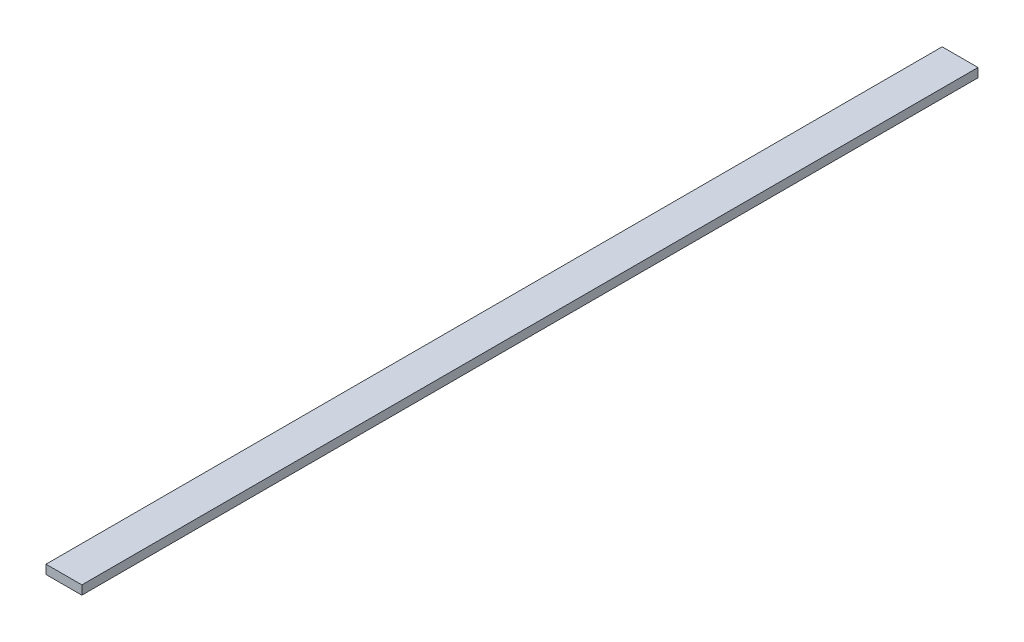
ISO-10303-21;
HEADER;
FILE_DESCRIPTION(('STEP AP214'),'2;1');
FILE_NAME('part.step','',(''),(''),'','','');
FILE_SCHEMA(('AUTOMOTIVE_DESIGN { 1 0 10303 214 1 1 1 1 }'));
ENDSEC;
DATA;
#1=APPLICATION_CONTEXT('core data for automotive mechanical design processes');
#2=APPLICATION_PROTOCOL_DEFINITION('international standard','automotive_design',2000,#1);
#3=PRODUCT_CONTEXT('',#1,'mechanical');
#4=PRODUCT('Part','Part','',(#3));
#5=PRODUCT_RELATED_PRODUCT_CATEGORY('part','',(#4));
#6=PRODUCT_DEFINITION_FORMATION('','',#4);
#7=PRODUCT_DEFINITION_CONTEXT('part definition',#1,'design');
#8=PRODUCT_DEFINITION('design','',#6,#7);
#9=PRODUCT_DEFINITION_SHAPE('','',#8);
#10=(LENGTH_UNIT() NAMED_UNIT(*) SI_UNIT(.MILLI.,.METRE.));
#11=(NAMED_UNIT(*) PLANE_ANGLE_UNIT() SI_UNIT($,.RADIAN.));
#12=(NAMED_UNIT(*) SI_UNIT($,.STERADIAN.) SOLID_ANGLE_UNIT());
#13=UNCERTAINTY_MEASURE_WITH_UNIT(LENGTH_MEASURE(1.E-05),#10,'distance_accuracy_value','');
#14=(GEOMETRIC_REPRESENTATION_CONTEXT(3) GLOBAL_UNCERTAINTY_ASSIGNED_CONTEXT((#13)) GLOBAL_UNIT_ASSIGNED_CONTEXT((#10,
#11,#12)) REPRESENTATION_CONTEXT('',''));
#15=CARTESIAN_POINT('',(0.,0.,0.));
#16=DIRECTION('',(0.,0.,1.));
#17=DIRECTION('',(1.,0.,0.));
#18=AXIS2_PLACEMENT_3D('',#15,#16,#17);
#19=CARTESIAN_POINT('',(-10.,5.,1900.));
#20=DIRECTION('',(1.,0.,0.));
#21=DIRECTION('',(0.,0.,-1.));
#22=AXIS2_PLACEMENT_3D('',#19,#20,#21);
#23=PLANE('',#22);
#24=DIRECTION('',(0.,-1.,0.));
#25=VECTOR('',#24,1.);
#26=CARTESIAN_POINT('',(-10.,5.,500.));
#27=LINE('',#26,#25);
#28=CARTESIAN_POINT('',(-10.,5.,500.));
#29=VERTEX_POINT('',#28);
#30=CARTESIAN_POINT('',(-10.,0.,500.));
#31=VERTEX_POINT('',#30);
#32=EDGE_CURVE('E54',#29,#31,#27,.T.);
#33=ORIENTED_EDGE('',*,*,#32,.F.);
#34=DIRECTION('',(0.,0.,-1.));
#35=VECTOR('',#34,1.);
#36=CARTESIAN_POINT('',(-10.,5.,1900.));
#37=LINE('',#36,#35);
#38=CARTESIAN_POINT('',(-10.,5.,0.));
#39=VERTEX_POINT('',#38);
#40=EDGE_CURVE('E36',#29,#39,#37,.T.);
#41=ORIENTED_EDGE('',*,*,#40,.T.);
#42=DIRECTION('',(0.,-1.,0.));
#43=VECTOR('',#42,1.);
#44=CARTESIAN_POINT('',(-10.,5.,0.));
#45=LINE('',#44,#43);
#46=CARTESIAN_POINT('',(-10.,0.,0.));
#47=VERTEX_POINT('',#46);
#48=EDGE_CURVE('E83',#39,#47,#45,.T.);
#49=ORIENTED_EDGE('',*,*,#48,.T.);
#50=DIRECTION('',(0.,0.,-1.));
#51=VECTOR('',#50,1.);
#52=CARTESIAN_POINT('',(-10.,0.,1900.));
#53=LINE('',#52,#51);
#54=EDGE_CURVE('E9',#31,#47,#53,.T.);
#55=ORIENTED_EDGE('',*,*,#54,.F.);
#56=EDGE_LOOP('',(#33,#41,#49,#55));
#57=FACE_BOUND('',#56,.T.);
#58=ADVANCED_FACE('F14',(#57),#23,.F.);
#59=CARTESIAN_POINT('',(-10.,0.,1900.));
#60=DIRECTION('',(0.,1.,0.));
#61=DIRECTION('',(0.,0.,1.));
#62=AXIS2_PLACEMENT_3D('',#59,#60,#61);
#63=PLANE('',#62);
#64=DIRECTION('',(1.,0.,0.));
#65=VECTOR('',#64,1.);
#66=CARTESIAN_POINT('',(-10.,0.,500.));
#67=LINE('',#66,#65);
#68=CARTESIAN_POINT('',(10.,0.,500.));
#69=VERTEX_POINT('',#68);
#70=EDGE_CURVE('E60',#31,#69,#67,.T.);
#71=ORIENTED_EDGE('',*,*,#70,.F.);
#72=ORIENTED_EDGE('',*,*,#54,.T.);
#73=DIRECTION('',(1.,0.,0.));
#74=VECTOR('',#73,1.);
#75=CARTESIAN_POINT('',(-10.,0.,0.));
#76=LINE('',#75,#74);
#77=CARTESIAN_POINT('',(10.,0.,0.));
#78=VERTEX_POINT('',#77);
#79=EDGE_CURVE('E80',#47,#78,#76,.T.);
#80=ORIENTED_EDGE('',*,*,#79,.T.);
#81=DIRECTION('',(0.,0.,-1.));
#82=VECTOR('',#81,1.);
#83=CARTESIAN_POINT('',(10.,0.,1900.));
#84=LINE('',#83,#82);
#85=EDGE_CURVE('E21',#69,#78,#84,.T.);
#86=ORIENTED_EDGE('',*,*,#85,.F.);
#87=EDGE_LOOP('',(#71,#72,#80,#86));
#88=FACE_BOUND('',#87,.T.);
#89=ADVANCED_FACE('F81',(#88),#63,.F.);
#90=CARTESIAN_POINT('',(10.,5.,1900.));
#91=DIRECTION('',(-1.,0.,0.));
#92=DIRECTION('',(0.,0.,1.));
#93=AXIS2_PLACEMENT_3D('',#90,#91,#92);
#94=PLANE('',#93);
#95=DIRECTION('',(0.,1.,0.));
#96=VECTOR('',#95,1.);
#97=CARTESIAN_POINT('',(10.,0.,500.));
#98=LINE('',#97,#96);
#99=CARTESIAN_POINT('',(10.,5.,500.));
#100=VERTEX_POINT('',#99);
#101=EDGE_CURVE('E28',#69,#100,#98,.T.);
#102=ORIENTED_EDGE('',*,*,#101,.F.);
#103=ORIENTED_EDGE('',*,*,#85,.T.);
#104=DIRECTION('',(0.,1.,0.));
#105=VECTOR('',#104,1.);
#106=CARTESIAN_POINT('',(10.,5.,0.));
#107=LINE('',#106,#105);
#108=CARTESIAN_POINT('',(10.,5.,0.));
#109=VERTEX_POINT('',#108);
#110=EDGE_CURVE('E69',#78,#109,#107,.T.);
#111=ORIENTED_EDGE('',*,*,#110,.T.);
#112=DIRECTION('',(0.,0.,-1.));
#113=VECTOR('',#112,1.);
#114=CARTESIAN_POINT('',(10.,5.,1900.));
#115=LINE('',#114,#113);
#116=EDGE_CURVE('E66',#100,#109,#115,.T.);
#117=ORIENTED_EDGE('',*,*,#116,.F.);
#118=EDGE_LOOP('',(#102,#103,#111,#117));
#119=FACE_BOUND('',#118,.T.);
#120=ADVANCED_FACE('F76',(#119),#94,.F.);
#121=CARTESIAN_POINT('',(-10.,5.,1900.));
#122=DIRECTION('',(0.,-1.,0.));
#123=DIRECTION('',(0.,0.,-1.));
#124=AXIS2_PLACEMENT_3D('',#121,#122,#123);
#125=PLANE('',#124);
#126=DIRECTION('',(-1.,0.,0.));
#127=VECTOR('',#126,1.);
#128=CARTESIAN_POINT('',(10.,5.,500.));
#129=LINE('',#128,#127);
#130=EDGE_CURVE('E52',#100,#29,#129,.T.);
#131=ORIENTED_EDGE('',*,*,#130,.F.);
#132=ORIENTED_EDGE('',*,*,#116,.T.);
#133=DIRECTION('',(-1.,0.,0.));
#134=VECTOR('',#133,1.);
#135=CARTESIAN_POINT('',(-10.,5.,0.));
#136=LINE('',#135,#134);
#137=EDGE_CURVE('E64',#109,#39,#136,.T.);
#138=ORIENTED_EDGE('',*,*,#137,.T.);
#139=ORIENTED_EDGE('',*,*,#40,.F.);
#140=EDGE_LOOP('',(#131,#132,#138,#139));
#141=FACE_BOUND('',#140,.T.);
#142=ADVANCED_FACE('F62',(#141),#125,.F.);
#143=CARTESIAN_POINT('',(-10.,0.,0.));
#144=DIRECTION('',(0.,0.,1.));
#145=DIRECTION('',(1.,0.,0.));
#146=AXIS2_PLACEMENT_3D('',#143,#144,#145);
#147=PLANE('',#146);
#148=ORIENTED_EDGE('',*,*,#48,.F.);
#149=ORIENTED_EDGE('',*,*,#137,.F.);
#150=ORIENTED_EDGE('',*,*,#110,.F.);
#151=ORIENTED_EDGE('',*,*,#79,.F.);
#152=EDGE_LOOP('',(#148,#149,#150,#151));
#153=FACE_BOUND('',#152,.T.);
#154=ADVANCED_FACE('F85',(#153),#147,.F.);
#155=CARTESIAN_POINT('',(-10.,5.,500.));
#156=DIRECTION('',(0.,0.,1.));
#157=DIRECTION('',(1.,0.,0.));
#158=AXIS2_PLACEMENT_3D('',#155,#156,#157);
#159=PLANE('',#158);
#160=ORIENTED_EDGE('',*,*,#130,.T.);
#161=ORIENTED_EDGE('',*,*,#32,.T.);
#162=ORIENTED_EDGE('',*,*,#70,.T.);
#163=ORIENTED_EDGE('',*,*,#101,.T.);
#164=EDGE_LOOP('',(#160,#161,#162,#163));
#165=FACE_BOUND('',#164,.T.);
#166=ADVANCED_FACE('F53',(#165),#159,.T.);
#167=CLOSED_SHELL('',(#58,#89,#120,#142,#154,#166));
#168=MANIFOLD_SOLID_BREP('B1',#167);
#169=ADVANCED_BREP_SHAPE_REPRESENTATION('',(#18,#168),#14);
#170=SHAPE_DEFINITION_REPRESENTATION(#9,#169);
ENDSEC;
END-ISO-10303-21;
